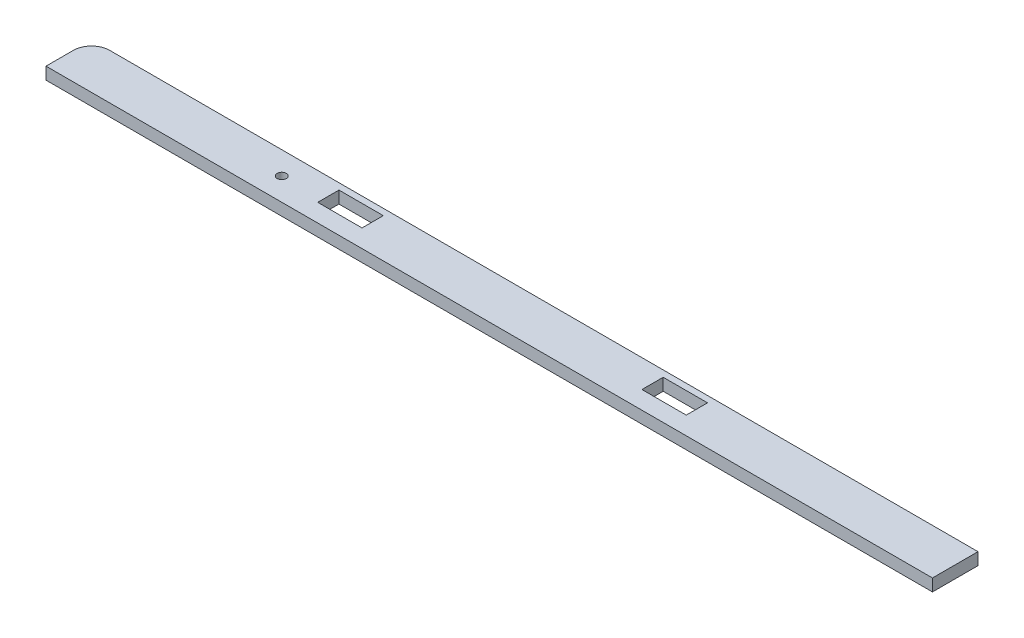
from build123d import *

# Parameters (mm, degrees)
SKETCH1_W           = 292
SKETCH1_H           = 15
SKETCH1_R           = 1.5
BOSS_EXTRUDE1_DEPTH = 4
SKETCH2_W           = 14.6
SKETCH2_H           = 7
CUT_EXTRUDE1_DEPTH  = 194.540693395
SKETCH3_W           = 14.6
SKETCH3_H           = 7
CUT_EXTRUDE2_DEPTH  = 194.540693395
FILLET1_R           = 6


with BuildPart() as part:
    # Sketch1 → Boss-Extrude1 (new body)
    with BuildSketch(Plane(origin=(0, 3, 0), x_dir=(1, 0, 0), z_dir=(0, 1, 0))):
        with Locations((5, 113.5)):
            Rectangle(SKETCH1_W, SKETCH1_H)
        with Locations(Location((-70.85, 113.5, 0), (0, 0, 270))):
            Circle(SKETCH1_R, mode=Mode.SUBTRACT)
    extrude(amount=-BOSS_EXTRUDE1_DEPTH)

    # Sketch2 → Cut-Extrude1 (cut, through all)
    with BuildSketch(Plane(origin=(0, 3, 0), x_dir=(-1, 0, 0), z_dir=(0, 1, 0))):
        with Locations((-56.7, -115.4)):
            Rectangle(SKETCH2_W, SKETCH2_H)
        with BuildLine():
            Line((-57.401923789, -116.9), (-53.4, -116.9))
            ThreePointArc((-53.4, -116.9), (-51.9, -115.4), (-53.4, -113.9))
            Line((-53.4, -113.9), (-57.401923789, -113.9))
            ThreePointArc((-57.401923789, -113.9), (-57, -115.4), (-57.401923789, -116.9))
        make_face(mode=Mode.SUBTRACT)
    extrude(amount=-CUT_EXTRUDE1_DEPTH, mode=Mode.SUBTRACT)


with BuildPart() as body_2:
    # of the pieces the cut leaves, the one that is kept (cut_extrude1_keep)
    add(part.part.solids().sort_by_distance((-141, 3, -106))[0])

    # Sketch3 → Cut-Extrude2 (cut, through all)
    with BuildSketch(Plane(origin=(0, 3, 0), x_dir=(-1, 0, 0), z_dir=(0, 1, 0))):
        with Locations((50.1, -115.4)):
            Rectangle(SKETCH3_W, SKETCH3_H)
        with BuildLine():
            Line((49.398076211, -116.9), (53.4, -116.9))
            ThreePointArc((53.4, -116.9), (54.9, -115.4), (53.4, -113.9))
            Line((53.4, -113.9), (49.398076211, -113.9))
            ThreePointArc((49.398076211, -113.9), (49.8, -115.4), (49.398076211, -116.9))
        make_face(mode=Mode.SUBTRACT)
    extrude(amount=-CUT_EXTRUDE2_DEPTH, mode=Mode.SUBTRACT)


with BuildPart() as body_2_2:
    # of the pieces the cut leaves, the one that is kept (cut_extrude2_keep)
    add(body_2.part.solids().sort_by_distance((-141, 3, -106))[0])

    # Fillet1
    fillet1_edges = [body_2_2.edges().sort_by_distance(p)[0] for p in [
        (-141, 1, -121),
    ]]
    fillet(fillet1_edges, radius=FILLET1_R)


solid = body_2_2.part
